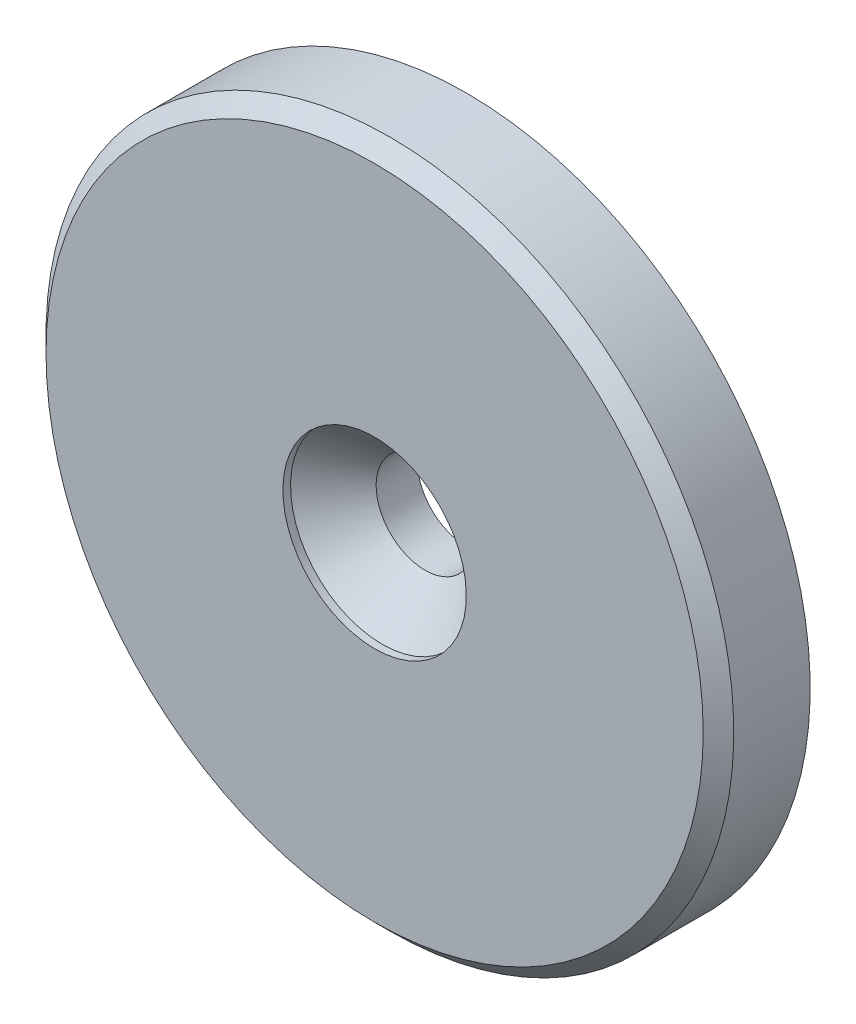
ISO-10303-21;
HEADER;
FILE_DESCRIPTION(('STEP AP214'),'2;1');
FILE_NAME('part.step','',(''),(''),'','','');
FILE_SCHEMA(('AUTOMOTIVE_DESIGN { 1 0 10303 214 1 1 1 1 }'));
ENDSEC;
DATA;
#1=APPLICATION_CONTEXT('core data for automotive mechanical design processes');
#2=APPLICATION_PROTOCOL_DEFINITION('international standard','automotive_design',2000,#1);
#3=PRODUCT_CONTEXT('',#1,'mechanical');
#4=PRODUCT('Part','Part','',(#3));
#5=PRODUCT_RELATED_PRODUCT_CATEGORY('part','',(#4));
#6=PRODUCT_DEFINITION_FORMATION('','',#4);
#7=PRODUCT_DEFINITION_CONTEXT('part definition',#1,'design');
#8=PRODUCT_DEFINITION('design','',#6,#7);
#9=PRODUCT_DEFINITION_SHAPE('','',#8);
#10=(LENGTH_UNIT() NAMED_UNIT(*) SI_UNIT(.MILLI.,.METRE.));
#11=(NAMED_UNIT(*) PLANE_ANGLE_UNIT() SI_UNIT($,.RADIAN.));
#12=(NAMED_UNIT(*) SI_UNIT($,.STERADIAN.) SOLID_ANGLE_UNIT());
#13=UNCERTAINTY_MEASURE_WITH_UNIT(LENGTH_MEASURE(1.E-05),#10,'distance_accuracy_value','');
#14=(GEOMETRIC_REPRESENTATION_CONTEXT(3) GLOBAL_UNCERTAINTY_ASSIGNED_CONTEXT((#13)) GLOBAL_UNIT_ASSIGNED_CONTEXT((#10,
#11,#12)) REPRESENTATION_CONTEXT('',''));
#15=CARTESIAN_POINT('',(0.,0.,0.));
#16=DIRECTION('',(0.,0.,1.));
#17=DIRECTION('',(1.,0.,0.));
#18=AXIS2_PLACEMENT_3D('',#15,#16,#17);
#19=CARTESIAN_POINT('',(0.,0.,2.7));
#20=DIRECTION('',(0.,0.,1.));
#21=DIRECTION('',(0.,-1.,0.));
#22=AXIS2_PLACEMENT_3D('',#19,#20,#21);
#23=CONICAL_SURFACE('',#22,3.2,0.785398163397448);
#24=CARTESIAN_POINT('',(0.,0.,5.5));
#25=DIRECTION('',(0.,0.,1.));
#26=DIRECTION('',(0.,-1.,0.));
#27=AXIS2_PLACEMENT_3D('',#24,#25,#26);
#28=CIRCLE('',#27,6.);
#29=CARTESIAN_POINT('',(0.,-6.,5.5));
#30=VERTEX_POINT('',#29);
#31=EDGE_CURVE('E37',#30,#30,#28,.T.);
#32=ORIENTED_EDGE('',*,*,#31,.T.);
#33=EDGE_LOOP('',(#32));
#34=FACE_BOUND('',#33,.T.);
#35=CARTESIAN_POINT('',(0.,0.,2.7));
#36=DIRECTION('',(0.,0.,1.));
#37=DIRECTION('',(0.,-1.,0.));
#38=AXIS2_PLACEMENT_3D('',#35,#36,#37);
#39=CIRCLE('',#38,3.2);
#40=CARTESIAN_POINT('',(0.,-3.2,2.7));
#41=VERTEX_POINT('',#40);
#42=EDGE_CURVE('E8',#41,#41,#39,.T.);
#43=ORIENTED_EDGE('',*,*,#42,.F.);
#44=EDGE_LOOP('',(#43));
#45=FACE_BOUND('',#44,.T.);
#46=ADVANCED_FACE('F12',(#34,#45),#23,.F.);
#47=CARTESIAN_POINT('',(0.,0.,6.67268120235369));
#48=DIRECTION('',(0.,0.,1.));
#49=DIRECTION('',(0.,-1.,0.));
#50=AXIS2_PLACEMENT_3D('',#47,#48,#49);
#51=CYLINDRICAL_SURFACE('',#50,3.2);
#52=ORIENTED_EDGE('',*,*,#42,.T.);
#53=EDGE_LOOP('',(#52));
#54=FACE_BOUND('',#53,.T.);
#55=CARTESIAN_POINT('',(0.,0.,0.));
#56=DIRECTION('',(0.,0.,1.));
#57=DIRECTION('',(0.,-1.,0.));
#58=AXIS2_PLACEMENT_3D('',#55,#56,#57);
#59=CIRCLE('',#58,3.2);
#60=CARTESIAN_POINT('',(0.,-3.2,0.));
#61=VERTEX_POINT('',#60);
#62=EDGE_CURVE('E18',#61,#61,#59,.T.);
#63=ORIENTED_EDGE('',*,*,#62,.F.);
#64=EDGE_LOOP('',(#63));
#65=FACE_BOUND('',#64,.T.);
#66=ADVANCED_FACE('F57',(#54,#65),#51,.F.);
#67=CARTESIAN_POINT('',(-3.2,0.,0.));
#68=DIRECTION('',(0.,0.,-1.));
#69=DIRECTION('',(0.,1.,0.));
#70=AXIS2_PLACEMENT_3D('',#67,#68,#69);
#71=PLANE('',#70);
#72=ORIENTED_EDGE('',*,*,#62,.T.);
#73=EDGE_LOOP('',(#72));
#74=FACE_BOUND('',#73,.T.);
#75=CARTESIAN_POINT('',(0.,0.,0.));
#76=DIRECTION('',(0.,0.,1.));
#77=DIRECTION('',(0.,-1.,0.));
#78=AXIS2_PLACEMENT_3D('',#75,#76,#77);
#79=CIRCLE('',#78,22.5);
#80=CARTESIAN_POINT('',(0.,-22.5,0.));
#81=VERTEX_POINT('',#80);
#82=EDGE_CURVE('E22',#81,#81,#79,.T.);
#83=ORIENTED_EDGE('',*,*,#82,.F.);
#84=EDGE_LOOP('',(#83));
#85=FACE_BOUND('',#84,.T.);
#86=ADVANCED_FACE('F62',(#74,#85),#71,.T.);
#87=CARTESIAN_POINT('',(0.,0.,6.67268120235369));
#88=DIRECTION('',(0.,0.,1.));
#89=DIRECTION('',(0.,-1.,0.));
#90=AXIS2_PLACEMENT_3D('',#87,#88,#89);
#91=CYLINDRICAL_SURFACE('',#90,22.5);
#92=ORIENTED_EDGE('',*,*,#82,.T.);
#93=EDGE_LOOP('',(#92));
#94=FACE_BOUND('',#93,.T.);
#95=CARTESIAN_POINT('',(0.,0.,5.));
#96=DIRECTION('',(0.,0.,1.));
#97=DIRECTION('',(0.,-1.,0.));
#98=AXIS2_PLACEMENT_3D('',#95,#96,#97);
#99=CIRCLE('',#98,22.5);
#100=CARTESIAN_POINT('',(0.,-22.5,5.));
#101=VERTEX_POINT('',#100);
#102=EDGE_CURVE('E26',#101,#101,#99,.T.);
#103=ORIENTED_EDGE('',*,*,#102,.F.);
#104=EDGE_LOOP('',(#103));
#105=FACE_BOUND('',#104,.T.);
#106=ADVANCED_FACE('F67',(#94,#105),#91,.T.);
#107=CARTESIAN_POINT('',(0.,0.,6.));
#108=DIRECTION('',(0.,0.,-1.));
#109=DIRECTION('',(0.,1.,0.));
#110=AXIS2_PLACEMENT_3D('',#107,#108,#109);
#111=CONICAL_SURFACE('',#110,21.5,0.785398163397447);
#112=ORIENTED_EDGE('',*,*,#102,.T.);
#113=EDGE_LOOP('',(#112));
#114=FACE_BOUND('',#113,.T.);
#115=CARTESIAN_POINT('',(0.,0.,6.));
#116=DIRECTION('',(0.,0.,1.));
#117=DIRECTION('',(0.,-1.,0.));
#118=AXIS2_PLACEMENT_3D('',#115,#116,#117);
#119=CIRCLE('',#118,21.5);
#120=CARTESIAN_POINT('',(0.,-21.5,6.));
#121=VERTEX_POINT('',#120);
#122=EDGE_CURVE('E31',#121,#121,#119,.T.);
#123=ORIENTED_EDGE('',*,*,#122,.F.);
#124=EDGE_LOOP('',(#123));
#125=FACE_BOUND('',#124,.T.);
#126=ADVANCED_FACE('F53',(#114,#125),#111,.T.);
#127=CARTESIAN_POINT('',(-6.,0.,6.));
#128=DIRECTION('',(0.,0.,1.));
#129=DIRECTION('',(0.,-1.,0.));
#130=AXIS2_PLACEMENT_3D('',#127,#128,#129);
#131=PLANE('',#130);
#132=ORIENTED_EDGE('',*,*,#122,.T.);
#133=EDGE_LOOP('',(#132));
#134=FACE_BOUND('',#133,.T.);
#135=CARTESIAN_POINT('',(0.,0.,6.));
#136=DIRECTION('',(0.,0.,1.));
#137=DIRECTION('',(0.,-1.,0.));
#138=AXIS2_PLACEMENT_3D('',#135,#136,#137);
#139=CIRCLE('',#138,6.);
#140=CARTESIAN_POINT('',(0.,-6.,6.));
#141=VERTEX_POINT('',#140);
#142=EDGE_CURVE('E34',#141,#141,#139,.T.);
#143=ORIENTED_EDGE('',*,*,#142,.F.);
#144=EDGE_LOOP('',(#143));
#145=FACE_BOUND('',#144,.T.);
#146=ADVANCED_FACE('F45',(#134,#145),#131,.T.);
#147=CARTESIAN_POINT('',(0.,0.,6.67268120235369));
#148=DIRECTION('',(0.,0.,1.));
#149=DIRECTION('',(0.,-1.,0.));
#150=AXIS2_PLACEMENT_3D('',#147,#148,#149);
#151=CYLINDRICAL_SURFACE('',#150,6.);
#152=ORIENTED_EDGE('',*,*,#142,.T.);
#153=EDGE_LOOP('',(#152));
#154=FACE_BOUND('',#153,.T.);
#155=ORIENTED_EDGE('',*,*,#31,.F.);
#156=EDGE_LOOP('',(#155));
#157=FACE_BOUND('',#156,.T.);
#158=ADVANCED_FACE('F43',(#154,#157),#151,.F.);
#159=CLOSED_SHELL('',(#46,#66,#86,#106,#126,#146,#158));
#160=MANIFOLD_SOLID_BREP('B1',#159);
#161=ADVANCED_BREP_SHAPE_REPRESENTATION('',(#18,#160),#14);
#162=SHAPE_DEFINITION_REPRESENTATION(#9,#161);
ENDSEC;
END-ISO-10303-21;
